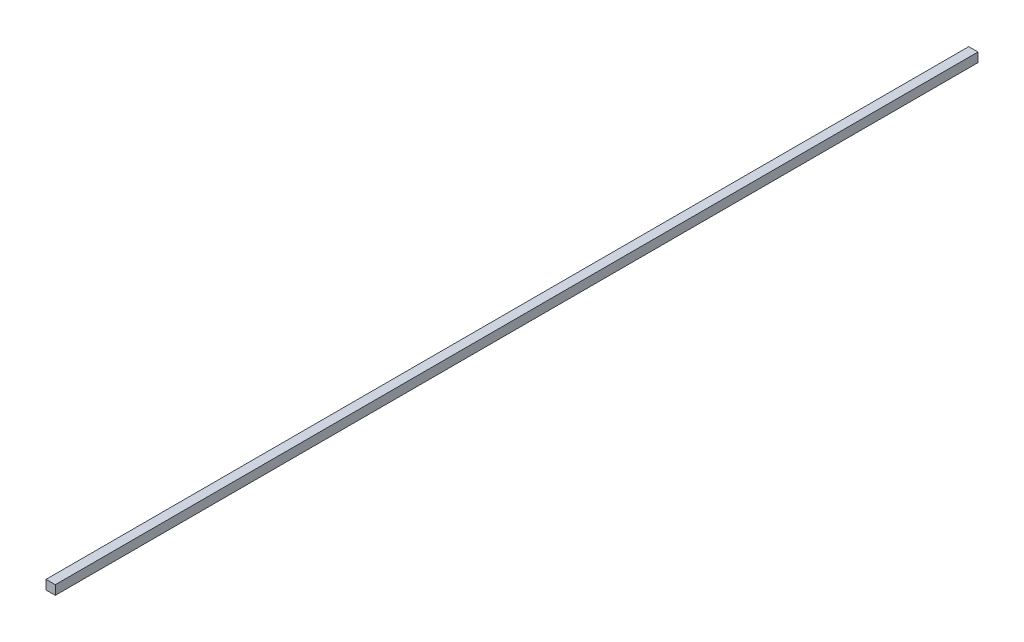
from build123d import *

# Parameters (mm, degrees)
SKETCH1_W           = 4.7625
SKETCH1_H           = 4.7625
BOSS_EXTRUDE1_DEPTH = 474.389


with BuildPart() as part:
    # Sketch1 → Boss-Extrude1 (new body)
    with BuildSketch(Plane.XY):
        with Locations((2.38125, 2.38125)):
            Rectangle(SKETCH1_W, SKETCH1_H)
    extrude(amount=BOSS_EXTRUDE1_DEPTH)


solid = part.part
